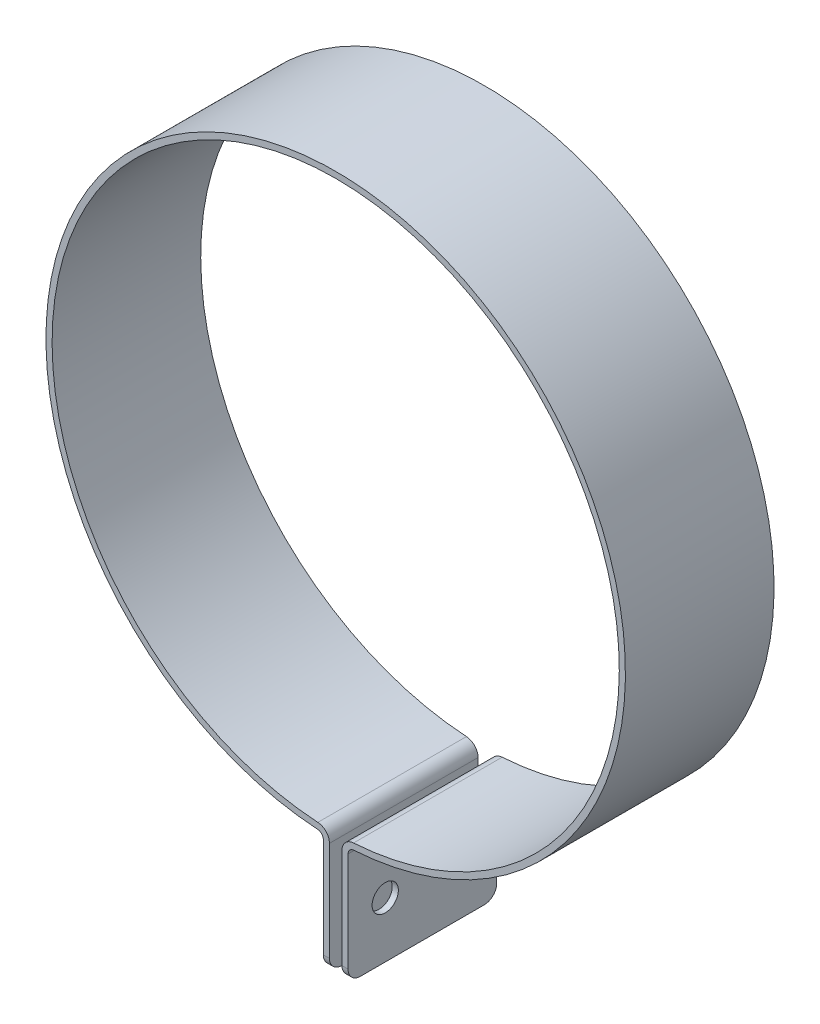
from build123d import *

# Parameters (mm, degrees)
SKETCH1_R           = 74.2823
SKETCH1_R_2         = 72.7075
BOSS_EXTRUDE1_DEPTH = 38.1
SKETCH2_W           = 6.35
SKETCH2_H           = 31.75
BOSS_EXTRUDE2_DEPTH = 38.1
SKETCH3_W           = 3.2004
SKETCH3_H           = 44.45
CUT_EXTRUDE1_DEPTH  = 134.719255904
FILLET1_R           = 1.5748
FILLET2_R           = 3.175
SKETCH4_R           = 3.3655
CUT_EXTRUDE2_DEPTH  = 136.50871791


with BuildPart() as part:
    # Sketch1 → Boss-Extrude1 (new body)
    with BuildSketch(Plane.XY):
        Circle(SKETCH1_R)
        Circle(SKETCH1_R_2, mode=Mode.SUBTRACT)
    extrude(amount=-BOSS_EXTRUDE1_DEPTH)

    # Sketch2 → Boss-Extrude2 (add)
    with BuildSketch(Plane.XY):
        with Locations((0, -88.5825)):
            Rectangle(SKETCH2_W, SKETCH2_H)
    extrude(amount=-BOSS_EXTRUDE2_DEPTH)

    # Sketch3 → Cut-Extrude1 (cut, through all)
    with BuildSketch(Plane.XY):
        with Locations((0, -88.5825)):
            Rectangle(SKETCH3_W, SKETCH3_H)
    extrude(amount=-CUT_EXTRUDE1_DEPTH, mode=Mode.SUBTRACT)

    # Fillet1
    fillet1_edges = [part.edges().sort_by_distance(p)[0] for p in [
        (-3.175, -74.214415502, -19.05),
        (3.175, -74.214415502, -19.05),
    ]]
    fillet(fillet1_edges, radius=FILLET1_R)

    # Fillet2
    fillet2_edges = [part.edges().sort_by_distance(p)[0] for p in [
        (-2.3876, -104.4575, -38.1),
        (-2.3876, -104.4575, 0),
        (2.3876, -104.4575, 0),
        (2.3876, -104.4575, -38.1),
        (-1.6002, -72.689888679, -19.05),
        (1.6002, -72.689888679, -19.05),
    ]]
    fillet(fillet2_edges, radius=FILLET2_R)

    # Sketch4 → Cut-Extrude2 (cut, through all)
    with BuildSketch(Plane(origin=(3.175, 0, 0), x_dir=(0, 0, -1), z_dir=(1, 0, 0))):
        with Locations((9.525, -90.1827)):
            Circle(SKETCH4_R)
        with Locations((28.575, -90.1827)):
            Circle(SKETCH4_R)
    extrude(amount=-CUT_EXTRUDE2_DEPTH, mode=Mode.SUBTRACT)


solid = part.part
